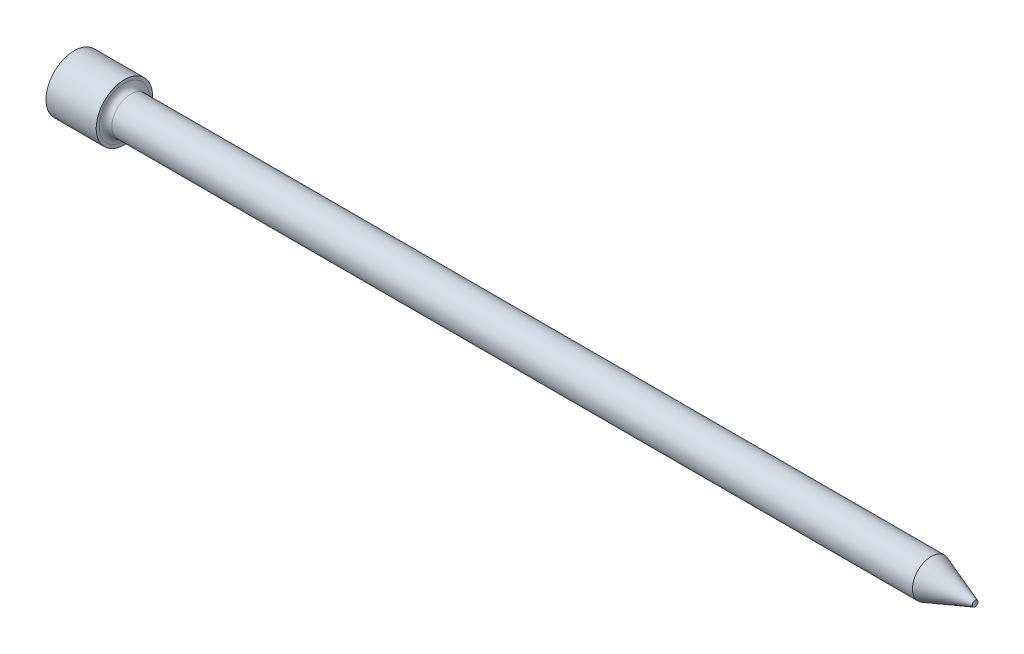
ISO-10303-21;
HEADER;
FILE_DESCRIPTION(('STEP AP214'),'2;1');
FILE_NAME('part.step','',(''),(''),'','','');
FILE_SCHEMA(('AUTOMOTIVE_DESIGN { 1 0 10303 214 1 1 1 1 }'));
ENDSEC;
DATA;
#1=APPLICATION_CONTEXT('core data for automotive mechanical design processes');
#2=APPLICATION_PROTOCOL_DEFINITION('international standard','automotive_design',2000,#1);
#3=PRODUCT_CONTEXT('',#1,'mechanical');
#4=PRODUCT('Part','Part','',(#3));
#5=PRODUCT_RELATED_PRODUCT_CATEGORY('part','',(#4));
#6=PRODUCT_DEFINITION_FORMATION('','',#4);
#7=PRODUCT_DEFINITION_CONTEXT('part definition',#1,'design');
#8=PRODUCT_DEFINITION('design','',#6,#7);
#9=PRODUCT_DEFINITION_SHAPE('','',#8);
#10=(LENGTH_UNIT() NAMED_UNIT(*) SI_UNIT(.MILLI.,.METRE.));
#11=(NAMED_UNIT(*) PLANE_ANGLE_UNIT() SI_UNIT($,.RADIAN.));
#12=(NAMED_UNIT(*) SI_UNIT($,.STERADIAN.) SOLID_ANGLE_UNIT());
#13=UNCERTAINTY_MEASURE_WITH_UNIT(LENGTH_MEASURE(1.E-05),#10,'distance_accuracy_value','');
#14=(GEOMETRIC_REPRESENTATION_CONTEXT(3) GLOBAL_UNCERTAINTY_ASSIGNED_CONTEXT((#13)) GLOBAL_UNIT_ASSIGNED_CONTEXT((#10,
#11,#12)) REPRESENTATION_CONTEXT('',''));
#15=CARTESIAN_POINT('',(0.,0.,0.));
#16=DIRECTION('',(0.,0.,1.));
#17=DIRECTION('',(1.,0.,0.));
#18=AXIS2_PLACEMENT_3D('',#15,#16,#17);
#19=CARTESIAN_POINT('',(0.,2.25,0.));
#20=DIRECTION('',(1.,0.,0.));
#21=DIRECTION('',(0.,0.,-1.));
#22=AXIS2_PLACEMENT_3D('',#19,#20,#21);
#23=PLANE('',#22);
#24=CARTESIAN_POINT('',(0.,0.,0.));
#25=DIRECTION('',(-1.,0.,0.));
#26=DIRECTION('',(0.,0.,1.));
#27=AXIS2_PLACEMENT_3D('',#24,#25,#26);
#28=CIRCLE('',#27,2.25);
#29=CARTESIAN_POINT('',(0.,0.,2.25));
#30=VERTEX_POINT('',#29);
#31=EDGE_CURVE('E54',#30,#30,#28,.T.);
#32=ORIENTED_EDGE('',*,*,#31,.T.);
#33=EDGE_LOOP('',(#32));
#34=FACE_BOUND('',#33,.T.);
#35=ADVANCED_FACE('F32',(#34),#23,.F.);
#36=CARTESIAN_POINT('',(0.,0.,0.));
#37=DIRECTION('',(-1.,0.,0.));
#38=DIRECTION('',(0.,0.,1.));
#39=AXIS2_PLACEMENT_3D('',#36,#37,#38);
#40=CYLINDRICAL_SURFACE('',#39,1.5);
#41=CARTESIAN_POINT('',(68.33333333,0.,0.));
#42=DIRECTION('',(1.,0.,0.));
#43=DIRECTION('',(0.,1.,0.));
#44=AXIS2_PLACEMENT_3D('',#41,#42,#43);
#45=CIRCLE('',#44,1.50000000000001);
#46=CARTESIAN_POINT('',(68.33333333,-1.5,0.));
#47=VERTEX_POINT('',#46);
#48=EDGE_CURVE('E60',#47,#47,#45,.T.);
#49=ORIENTED_EDGE('',*,*,#48,.F.);
#50=EDGE_LOOP('',(#49));
#51=FACE_BOUND('',#50,.T.);
#52=CARTESIAN_POINT('',(4.5,0.,0.));
#53=DIRECTION('',(-1.,0.,0.));
#54=DIRECTION('',(0.,0.,1.));
#55=AXIS2_PLACEMENT_3D('',#52,#53,#54);
#56=CIRCLE('',#55,1.5);
#57=CARTESIAN_POINT('',(4.5,0.,1.5));
#58=VERTEX_POINT('',#57);
#59=EDGE_CURVE('E10',#58,#58,#56,.T.);
#60=ORIENTED_EDGE('',*,*,#59,.F.);
#61=EDGE_LOOP('',(#60));
#62=FACE_BOUND('',#61,.T.);
#63=ADVANCED_FACE('F76',(#51,#62),#40,.T.);
#64=CARTESIAN_POINT('',(4.5,0.,0.));
#65=DIRECTION('',(-1.,0.,0.));
#66=DIRECTION('',(0.,0.,1.));
#67=AXIS2_PLACEMENT_3D('',#64,#65,#66);
#68=TOROIDAL_SURFACE('',#67,2.,0.5);
#69=ORIENTED_EDGE('',*,*,#59,.T.);
#70=EDGE_LOOP('',(#69));
#71=FACE_BOUND('',#70,.T.);
#72=CARTESIAN_POINT('',(4.,0.,0.));
#73=DIRECTION('',(-1.,0.,0.));
#74=DIRECTION('',(0.,0.,1.));
#75=AXIS2_PLACEMENT_3D('',#72,#73,#74);
#76=CIRCLE('',#75,2.);
#77=CARTESIAN_POINT('',(4.,0.,2.));
#78=VERTEX_POINT('',#77);
#79=EDGE_CURVE('E39',#78,#78,#76,.T.);
#80=ORIENTED_EDGE('',*,*,#79,.F.);
#81=EDGE_LOOP('',(#80));
#82=FACE_BOUND('',#81,.T.);
#83=ADVANCED_FACE('F79',(#71,#82),#68,.F.);
#84=CARTESIAN_POINT('',(4.,2.,0.));
#85=DIRECTION('',(-1.,0.,0.));
#86=DIRECTION('',(0.,0.,1.));
#87=AXIS2_PLACEMENT_3D('',#84,#85,#86);
#88=PLANE('',#87);
#89=CARTESIAN_POINT('',(4.,0.,0.));
#90=DIRECTION('',(-1.,0.,0.));
#91=DIRECTION('',(0.,0.,1.));
#92=AXIS2_PLACEMENT_3D('',#89,#90,#91);
#93=CIRCLE('',#92,2.25);
#94=CARTESIAN_POINT('',(4.,0.,2.25));
#95=VERTEX_POINT('',#94);
#96=EDGE_CURVE('E47',#95,#95,#93,.T.);
#97=ORIENTED_EDGE('',*,*,#96,.F.);
#98=EDGE_LOOP('',(#97));
#99=FACE_BOUND('',#98,.T.);
#100=ORIENTED_EDGE('',*,*,#79,.T.);
#101=EDGE_LOOP('',(#100));
#102=FACE_BOUND('',#101,.T.);
#103=ADVANCED_FACE('F84',(#99,#102),#88,.F.);
#104=CARTESIAN_POINT('',(0.,0.,0.));
#105=DIRECTION('',(-1.,0.,0.));
#106=DIRECTION('',(0.,0.,1.));
#107=AXIS2_PLACEMENT_3D('',#104,#105,#106);
#108=CYLINDRICAL_SURFACE('',#107,2.25);
#109=ORIENTED_EDGE('',*,*,#31,.F.);
#110=EDGE_LOOP('',(#109));
#111=FACE_BOUND('',#110,.T.);
#112=ORIENTED_EDGE('',*,*,#96,.T.);
#113=EDGE_LOOP('',(#112));
#114=FACE_BOUND('',#113,.T.);
#115=ADVANCED_FACE('F72',(#111,#114),#108,.T.);
#116=CARTESIAN_POINT('',(68.33333333,0.,0.));
#117=DIRECTION('',(-1.,0.,0.));
#118=DIRECTION('',(0.,-1.,0.));
#119=AXIS2_PLACEMENT_3D('',#116,#117,#118);
#120=CONICAL_SURFACE('',#119,1.50000000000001,0.34906585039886);
#121=CARTESIAN_POINT('',(71.83333333,0.,0.));
#122=DIRECTION('',(1.,0.,0.));
#123=DIRECTION('',(0.,1.,0.));
#124=AXIS2_PLACEMENT_3D('',#121,#122,#123);
#125=CIRCLE('',#124,0.226104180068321);
#126=CARTESIAN_POINT('',(71.83333333,-0.22610418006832,0.));
#127=VERTEX_POINT('',#126);
#128=EDGE_CURVE('E63',#127,#127,#125,.T.);
#129=CARTESIAN_POINT('',(71.83333333,-0.22610418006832,0.));
#130=CARTESIAN_POINT('',(71.7968749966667,-0.239373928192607,0.));
#131=CARTESIAN_POINT('',(71.7604166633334,-0.252643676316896,0.));
#132=CARTESIAN_POINT('',(71.6874999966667,-0.279183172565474,0.));
#133=CARTESIAN_POINT('',(71.6510416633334,-0.292452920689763,0.));
#134=CARTESIAN_POINT('',(71.5781249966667,-0.318992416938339,0.));
#135=CARTESIAN_POINT('',(71.5416666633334,-0.332262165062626,0.));
#136=CARTESIAN_POINT('',(71.4687499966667,-0.358801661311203,0.));
#137=CARTESIAN_POINT('',(71.4322916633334,-0.372071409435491,0.));
#138=CARTESIAN_POINT('',(71.3593749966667,-0.398610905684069,0.));
#139=CARTESIAN_POINT('',(71.3229166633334,-0.411880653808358,0.));
#140=CARTESIAN_POINT('',(71.2499999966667,-0.438420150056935,0.));
#141=CARTESIAN_POINT('',(71.2135416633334,-0.451689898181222,0.));
#142=CARTESIAN_POINT('',(71.1406249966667,-0.478229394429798,0.));
#143=CARTESIAN_POINT('',(71.1041666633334,-0.491499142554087,0.));
#144=CARTESIAN_POINT('',(71.0312499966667,-0.518038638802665,0.));
#145=CARTESIAN_POINT('',(70.9947916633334,-0.531308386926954,0.));
#146=CARTESIAN_POINT('',(70.9218749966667,-0.55784788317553,0.));
#147=CARTESIAN_POINT('',(70.8854166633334,-0.571117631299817,0.));
#148=CARTESIAN_POINT('',(70.8124999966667,-0.597657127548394,0.));
#149=CARTESIAN_POINT('',(70.7760416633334,-0.610926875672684,0.));
#150=CARTESIAN_POINT('',(70.7031249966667,-0.637466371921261,0.));
#151=CARTESIAN_POINT('',(70.6666666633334,-0.650736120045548,0.));
#152=CARTESIAN_POINT('',(70.5937499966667,-0.677275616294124,0.));
#153=CARTESIAN_POINT('',(70.5572916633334,-0.690545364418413,0.));
#154=CARTESIAN_POINT('',(70.4843749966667,-0.717084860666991,0.));
#155=CARTESIAN_POINT('',(70.4479166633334,-0.730354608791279,0.));
#156=CARTESIAN_POINT('',(70.3749999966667,-0.756894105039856,0.));
#157=CARTESIAN_POINT('',(70.3385416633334,-0.770163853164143,0.));
#158=CARTESIAN_POINT('',(70.2656249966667,-0.79670334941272,0.));
#159=CARTESIAN_POINT('',(70.2291666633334,-0.809973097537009,0.));
#160=CARTESIAN_POINT('',(70.1562499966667,-0.836512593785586,0.));
#161=CARTESIAN_POINT('',(70.1197916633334,-0.849782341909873,0.));
#162=CARTESIAN_POINT('',(70.0468749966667,-0.87632183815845,0.));
#163=CARTESIAN_POINT('',(70.0104166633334,-0.889591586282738,0.));
#164=CARTESIAN_POINT('',(69.9374999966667,-0.916131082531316,0.));
#165=CARTESIAN_POINT('',(69.9010416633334,-0.929400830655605,0.));
#166=CARTESIAN_POINT('',(69.8281249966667,-0.955940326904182,0.));
#167=CARTESIAN_POINT('',(69.7916666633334,-0.969210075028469,0.));
#168=CARTESIAN_POINT('',(69.7187499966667,-0.995749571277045,0.));
#169=CARTESIAN_POINT('',(69.6822916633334,-1.00901931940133,0.));
#170=CARTESIAN_POINT('',(69.6093749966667,-1.03555881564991,0.));
#171=CARTESIAN_POINT('',(69.5729166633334,-1.0488285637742,0.));
#172=CARTESIAN_POINT('',(69.4999999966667,-1.07536806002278,0.));
#173=CARTESIAN_POINT('',(69.4635416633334,-1.08863780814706,0.));
#174=CARTESIAN_POINT('',(69.3906249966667,-1.11517730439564,0.));
#175=CARTESIAN_POINT('',(69.3541666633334,-1.12844705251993,0.));
#176=CARTESIAN_POINT('',(69.2812499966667,-1.15498654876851,0.));
#177=CARTESIAN_POINT('',(69.2447916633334,-1.1682562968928,0.));
#178=CARTESIAN_POINT('',(69.1718749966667,-1.19479579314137,0.));
#179=CARTESIAN_POINT('',(69.1354166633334,-1.20806554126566,0.));
#180=CARTESIAN_POINT('',(69.0624999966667,-1.23460503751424,0.));
#181=CARTESIAN_POINT('',(69.0260416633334,-1.24787478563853,0.));
#182=CARTESIAN_POINT('',(68.9531249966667,-1.2744142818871,0.));
#183=CARTESIAN_POINT('',(68.9166666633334,-1.28768403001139,0.));
#184=CARTESIAN_POINT('',(68.8437499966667,-1.31422352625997,0.));
#185=CARTESIAN_POINT('',(68.8072916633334,-1.32749327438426,0.));
#186=CARTESIAN_POINT('',(68.7343749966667,-1.35403277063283,0.));
#187=CARTESIAN_POINT('',(68.6979166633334,-1.36730251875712,0.));
#188=CARTESIAN_POINT('',(68.6249999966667,-1.3938420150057,0.));
#189=CARTESIAN_POINT('',(68.5885416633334,-1.40711176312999,0.));
#190=CARTESIAN_POINT('',(68.5156249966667,-1.43365125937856,0.));
#191=CARTESIAN_POINT('',(68.4791666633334,-1.44692100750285,0.));
#192=CARTESIAN_POINT('',(68.4062499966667,-1.47346050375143,0.));
#193=CARTESIAN_POINT('',(68.3697916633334,-1.48673025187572,0.));
#194=CARTESIAN_POINT('',(68.33333333,-1.5,0.));
#195=B_SPLINE_CURVE_WITH_KNOTS('',3,(#129,#130,#131,#132,#133,#134,#135,#136,#137,#138,#139,
#140,#141,#142,#143,#144,#145,#146,#147,#148,#149,#150,#151,#152,#153,#154,#155,#156,#157,#158,
#159,#160,#161,#162,#163,#164,#165,#166,#167,#168,#169,#170,#171,#172,#173,#174,#175,#176,#177,
#178,#179,#180,#181,#182,#183,#184,#185,#186,#187,#188,#189,#190,#191,#192,#193,#194),
.UNSPECIFIED.,.F.,.F.,(4,2,2,2,2,2,2,2,2,2,2,2,2,2,2,2,2,2,2,2,2,2,2,2,2,2,2,2,2,2,2,2,4),(0.,
0.116394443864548,0.232788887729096,0.349183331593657,0.465577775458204,0.581972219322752,
0.698366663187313,0.814761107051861,0.931155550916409,1.04754999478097,1.16394443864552,
1.28033888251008,1.39673332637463,1.51312777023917,1.62952221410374,1.74591665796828,
1.86231110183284,1.97870554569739,2.09509998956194,2.2114944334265,2.32788887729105,
2.4442833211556,2.56067776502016,2.6770722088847,2.79346665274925,2.90986109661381,
3.02625554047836,3.14264998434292,3.25904442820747,3.37543887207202,3.49183331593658,
3.60822775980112,3.72462220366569),.UNSPECIFIED.);
#196=EDGE_CURVE('BSEAM69',#127,#47,#195,.T.);
#197=ORIENTED_EDGE('',*,*,#128,.F.);
#198=ORIENTED_EDGE('',*,*,#48,.T.);
#199=ORIENTED_EDGE('',*,*,#196,.T.);
#200=ORIENTED_EDGE('',*,*,#196,.F.);
#201=EDGE_LOOP('',(#197,#199,#198,#200));
#202=FACE_BOUND('',#201,.T.);
#203=ADVANCED_FACE('F69',(#202),#120,.T.);
#204=CARTESIAN_POINT('',(71.83333333,0.22610418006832,0.));
#205=DIRECTION('',(-1.,0.,0.));
#206=DIRECTION('',(0.,-1.,0.));
#207=AXIS2_PLACEMENT_3D('',#204,#205,#206);
#208=PLANE('',#207);
#209=ORIENTED_EDGE('',*,*,#128,.T.);
#210=EDGE_LOOP('',(#209));
#211=FACE_BOUND('',#210,.T.);
#212=ADVANCED_FACE('F67',(#211),#208,.F.);
#213=CLOSED_SHELL('',(#35,#63,#83,#103,#115,#203,#212));
#214=MANIFOLD_SOLID_BREP('B2',#213);
#215=ADVANCED_BREP_SHAPE_REPRESENTATION('',(#18,#214),#14);
#216=SHAPE_DEFINITION_REPRESENTATION(#9,#215);
ENDSEC;
END-ISO-10303-21;
